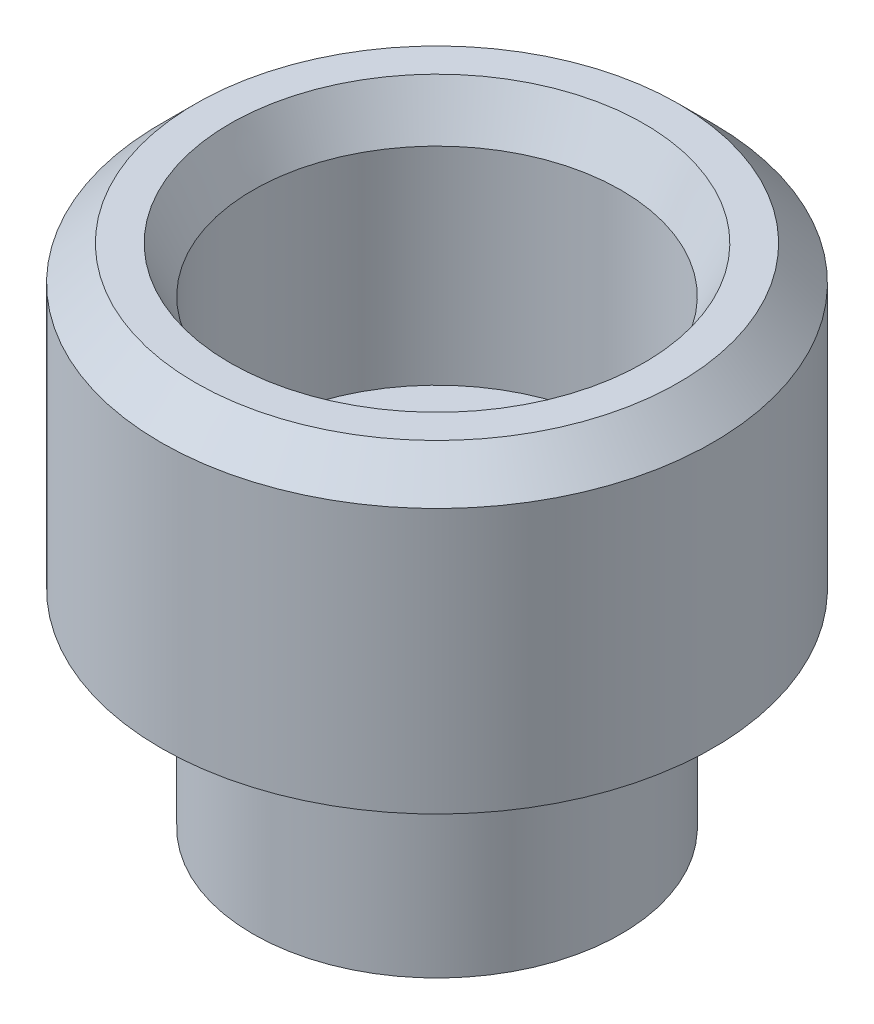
ISO-10303-21;
HEADER;
FILE_DESCRIPTION(('STEP AP214'),'2;1');
FILE_NAME('part.step','',(''),(''),'','','');
FILE_SCHEMA(('AUTOMOTIVE_DESIGN { 1 0 10303 214 1 1 1 1 }'));
ENDSEC;
DATA;
#1=APPLICATION_CONTEXT('core data for automotive mechanical design processes');
#2=APPLICATION_PROTOCOL_DEFINITION('international standard','automotive_design',2000,#1);
#3=PRODUCT_CONTEXT('',#1,'mechanical');
#4=PRODUCT('Part','Part','',(#3));
#5=PRODUCT_RELATED_PRODUCT_CATEGORY('part','',(#4));
#6=PRODUCT_DEFINITION_FORMATION('','',#4);
#7=PRODUCT_DEFINITION_CONTEXT('part definition',#1,'design');
#8=PRODUCT_DEFINITION('design','',#6,#7);
#9=PRODUCT_DEFINITION_SHAPE('','',#8);
#10=(LENGTH_UNIT() NAMED_UNIT(*) SI_UNIT(.MILLI.,.METRE.));
#11=(NAMED_UNIT(*) PLANE_ANGLE_UNIT() SI_UNIT($,.RADIAN.));
#12=(NAMED_UNIT(*) SI_UNIT($,.STERADIAN.) SOLID_ANGLE_UNIT());
#13=UNCERTAINTY_MEASURE_WITH_UNIT(LENGTH_MEASURE(1.E-05),#10,'distance_accuracy_value','');
#14=(GEOMETRIC_REPRESENTATION_CONTEXT(3) GLOBAL_UNCERTAINTY_ASSIGNED_CONTEXT((#13)) GLOBAL_UNIT_ASSIGNED_CONTEXT((#10,
#11,#12)) REPRESENTATION_CONTEXT('',''));
#15=CARTESIAN_POINT('',(0.,0.,0.));
#16=DIRECTION('',(0.,0.,1.));
#17=DIRECTION('',(1.,0.,0.));
#18=AXIS2_PLACEMENT_3D('',#15,#16,#17);
#19=CARTESIAN_POINT('',(0.,9.,0.));
#20=DIRECTION('',(0.,-1.,0.));
#21=DIRECTION('',(0.,0.,-1.));
#22=AXIS2_PLACEMENT_3D('',#19,#20,#21);
#23=CYLINDRICAL_SURFACE('',#22,8.);
#24=CARTESIAN_POINT('',(0.,6.5,0.));
#25=DIRECTION('',(0.,1.,0.));
#26=DIRECTION('',(0.,0.,1.));
#27=AXIS2_PLACEMENT_3D('',#24,#25,#26);
#28=CIRCLE('',#27,8.);
#29=CARTESIAN_POINT('',(0.,6.5,8.));
#30=VERTEX_POINT('',#29);
#31=EDGE_CURVE('E53',#30,#30,#28,.F.);
#32=ORIENTED_EDGE('',*,*,#31,.T.);
#33=EDGE_LOOP('',(#32));
#34=FACE_BOUND('',#33,.T.);
#35=CARTESIAN_POINT('',(0.,0.,0.));
#36=DIRECTION('',(0.,1.,0.));
#37=DIRECTION('',(0.,0.,1.));
#38=AXIS2_PLACEMENT_3D('',#35,#36,#37);
#39=CIRCLE('',#38,8.);
#40=CARTESIAN_POINT('',(0.,0.,8.));
#41=VERTEX_POINT('',#40);
#42=EDGE_CURVE('E56',#41,#41,#39,.T.);
#43=ORIENTED_EDGE('',*,*,#42,.T.);
#44=EDGE_LOOP('',(#43));
#45=FACE_BOUND('',#44,.T.);
#46=ADVANCED_FACE('F33',(#34,#45),#23,.T.);
#47=CARTESIAN_POINT('',(0.,0.,0.));
#48=DIRECTION('',(0.,1.,0.));
#49=DIRECTION('',(0.,0.,1.));
#50=AXIS2_PLACEMENT_3D('',#47,#48,#49);
#51=PLANE('',#50);
#52=CARTESIAN_POINT('',(0.,0.,0.));
#53=DIRECTION('',(0.,-1.,0.));
#54=DIRECTION('',(0.,0.,-1.));
#55=AXIS2_PLACEMENT_3D('',#52,#53,#54);
#56=CIRCLE('',#55,3.5);
#57=CARTESIAN_POINT('',(0.,0.,-3.5));
#58=VERTEX_POINT('',#57);
#59=EDGE_CURVE('E62',#58,#58,#56,.T.);
#60=ORIENTED_EDGE('',*,*,#59,.F.);
#61=EDGE_LOOP('',(#60));
#62=FACE_BOUND('',#61,.T.);
#63=ORIENTED_EDGE('',*,*,#42,.F.);
#64=EDGE_LOOP('',(#63));
#65=FACE_BOUND('',#64,.T.);
#66=ADVANCED_FACE('F87',(#62,#65),#51,.F.);
#67=CARTESIAN_POINT('',(0.,22.,0.));
#68=DIRECTION('',(0.,-1.,0.));
#69=DIRECTION('',(0.,0.,-1.));
#70=AXIS2_PLACEMENT_3D('',#67,#68,#69);
#71=CYLINDRICAL_SURFACE('',#70,12.);
#72=CARTESIAN_POINT('',(0.,20.5,0.));
#73=DIRECTION('',(0.,1.,0.));
#74=DIRECTION('',(0.,0.,1.));
#75=AXIS2_PLACEMENT_3D('',#72,#73,#74);
#76=CIRCLE('',#75,12.);
#77=CARTESIAN_POINT('',(0.,20.5,-12.));
#78=VERTEX_POINT('',#77);
#79=EDGE_CURVE('E44',#78,#78,#76,.F.);
#80=CARTESIAN_POINT('',(0.,9.,0.));
#81=DIRECTION('',(0.,1.,0.));
#82=DIRECTION('',(0.,0.,1.));
#83=AXIS2_PLACEMENT_3D('',#80,#81,#82);
#84=CIRCLE('',#83,12.);
#85=CARTESIAN_POINT('',(0.,9.,-12.));
#86=VERTEX_POINT('',#85);
#87=EDGE_CURVE('E59',#86,#86,#84,.T.);
#88=CARTESIAN_POINT('',(0.,20.5,-12.));
#89=CARTESIAN_POINT('',(0.,20.3802083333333,-12.));
#90=CARTESIAN_POINT('',(0.,20.2604166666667,-12.));
#91=CARTESIAN_POINT('',(0.,20.0208333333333,-12.));
#92=CARTESIAN_POINT('',(0.,19.9010416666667,-12.));
#93=CARTESIAN_POINT('',(0.,19.6614583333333,-12.));
#94=CARTESIAN_POINT('',(0.,19.5416666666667,-12.));
#95=CARTESIAN_POINT('',(0.,19.3020833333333,-12.));
#96=CARTESIAN_POINT('',(0.,19.1822916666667,-12.));
#97=CARTESIAN_POINT('',(0.,18.9427083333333,-12.));
#98=CARTESIAN_POINT('',(0.,18.8229166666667,-12.));
#99=CARTESIAN_POINT('',(0.,18.5833333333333,-12.));
#100=CARTESIAN_POINT('',(0.,18.4635416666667,-12.));
#101=CARTESIAN_POINT('',(0.,18.2239583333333,-12.));
#102=CARTESIAN_POINT('',(0.,18.1041666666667,-12.));
#103=CARTESIAN_POINT('',(0.,17.8645833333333,-12.));
#104=CARTESIAN_POINT('',(0.,17.7447916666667,-12.));
#105=CARTESIAN_POINT('',(0.,17.5052083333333,-12.));
#106=CARTESIAN_POINT('',(0.,17.3854166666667,-12.));
#107=CARTESIAN_POINT('',(0.,17.1458333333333,-12.));
#108=CARTESIAN_POINT('',(0.,17.0260416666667,-12.));
#109=CARTESIAN_POINT('',(0.,16.7864583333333,-12.));
#110=CARTESIAN_POINT('',(0.,16.6666666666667,-12.));
#111=CARTESIAN_POINT('',(0.,16.4270833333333,-12.));
#112=CARTESIAN_POINT('',(0.,16.3072916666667,-12.));
#113=CARTESIAN_POINT('',(0.,16.0677083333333,-12.));
#114=CARTESIAN_POINT('',(0.,15.9479166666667,-12.));
#115=CARTESIAN_POINT('',(0.,15.7083333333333,-12.));
#116=CARTESIAN_POINT('',(0.,15.5885416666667,-12.));
#117=CARTESIAN_POINT('',(0.,15.3489583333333,-12.));
#118=CARTESIAN_POINT('',(0.,15.2291666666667,-12.));
#119=CARTESIAN_POINT('',(0.,14.9895833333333,-12.));
#120=CARTESIAN_POINT('',(0.,14.8697916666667,-12.));
#121=CARTESIAN_POINT('',(0.,14.6302083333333,-12.));
#122=CARTESIAN_POINT('',(0.,14.5104166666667,-12.));
#123=CARTESIAN_POINT('',(0.,14.2708333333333,-12.));
#124=CARTESIAN_POINT('',(0.,14.1510416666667,-12.));
#125=CARTESIAN_POINT('',(0.,13.9114583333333,-12.));
#126=CARTESIAN_POINT('',(0.,13.7916666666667,-12.));
#127=CARTESIAN_POINT('',(0.,13.5520833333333,-12.));
#128=CARTESIAN_POINT('',(0.,13.4322916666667,-12.));
#129=CARTESIAN_POINT('',(0.,13.1927083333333,-12.));
#130=CARTESIAN_POINT('',(0.,13.0729166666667,-12.));
#131=CARTESIAN_POINT('',(0.,12.8333333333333,-12.));
#132=CARTESIAN_POINT('',(0.,12.7135416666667,-12.));
#133=CARTESIAN_POINT('',(0.,12.4739583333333,-12.));
#134=CARTESIAN_POINT('',(0.,12.3541666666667,-12.));
#135=CARTESIAN_POINT('',(0.,12.1145833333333,-12.));
#136=CARTESIAN_POINT('',(0.,11.9947916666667,-12.));
#137=CARTESIAN_POINT('',(0.,11.7552083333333,-12.));
#138=CARTESIAN_POINT('',(0.,11.6354166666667,-12.));
#139=CARTESIAN_POINT('',(0.,11.3958333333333,-12.));
#140=CARTESIAN_POINT('',(0.,11.2760416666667,-12.));
#141=CARTESIAN_POINT('',(0.,11.0364583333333,-12.));
#142=CARTESIAN_POINT('',(0.,10.9166666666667,-12.));
#143=CARTESIAN_POINT('',(0.,10.6770833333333,-12.));
#144=CARTESIAN_POINT('',(0.,10.5572916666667,-12.));
#145=CARTESIAN_POINT('',(0.,10.3177083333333,-12.));
#146=CARTESIAN_POINT('',(0.,10.1979166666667,-12.));
#147=CARTESIAN_POINT('',(0.,9.95833333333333,-12.));
#148=CARTESIAN_POINT('',(0.,9.83854166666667,-12.));
#149=CARTESIAN_POINT('',(0.,9.59895833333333,-12.));
#150=CARTESIAN_POINT('',(0.,9.47916666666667,-12.));
#151=CARTESIAN_POINT('',(0.,9.23958333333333,-12.));
#152=CARTESIAN_POINT('',(0.,9.11979166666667,-12.));
#153=CARTESIAN_POINT('',(0.,9.,-12.));
#154=B_SPLINE_CURVE_WITH_KNOTS('',3,(#88,#89,#90,#91,#92,#93,#94,#95,#96,#97,#98,#99,#100,#101,
#102,#103,#104,#105,#106,#107,#108,#109,#110,#111,#112,#113,#114,#115,#116,#117,#118,#119,#120,
#121,#122,#123,#124,#125,#126,#127,#128,#129,#130,#131,#132,#133,#134,#135,#136,#137,#138,#139,
#140,#141,#142,#143,#144,#145,#146,#147,#148,#149,#150,#151,#152,#153),.UNSPECIFIED.,.F.,.F.,(4,
2,2,2,2,2,2,2,2,2,2,2,2,2,2,2,2,2,2,2,2,2,2,2,2,2,2,2,2,2,2,2,4),(0.,0.359375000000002,
0.718750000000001,1.078125,1.4375,1.796875,2.15625,2.515625,2.875,3.234375,3.59375,
3.95312500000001,4.3125,4.671875,5.03125,5.390625,5.75000000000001,6.10937500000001,6.46875,
6.82812500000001,7.1875,7.54687500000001,7.90625000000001,8.26562500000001,8.62500000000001,
8.98437500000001,9.34375000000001,9.70312500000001,10.0625,10.421875,10.78125,11.140625,11.5),.UNSPECIFIED.);
#155=EDGE_CURVE('BSEAM93',#78,#86,#154,.T.);
#156=ORIENTED_EDGE('',*,*,#79,.T.);
#157=ORIENTED_EDGE('',*,*,#87,.T.);
#158=ORIENTED_EDGE('',*,*,#155,.T.);
#159=ORIENTED_EDGE('',*,*,#155,.F.);
#160=EDGE_LOOP('',(#156,#158,#157,#159));
#161=FACE_BOUND('',#160,.T.);
#162=ADVANCED_FACE('F93',(#161),#71,.T.);
#163=CARTESIAN_POINT('',(0.,22.,0.));
#164=DIRECTION('',(0.,1.,0.));
#165=DIRECTION('',(0.,0.,1.));
#166=AXIS2_PLACEMENT_3D('',#163,#164,#165);
#167=PLANE('',#166);
#168=CARTESIAN_POINT('',(0.,22.,0.));
#169=DIRECTION('',(0.,1.,0.));
#170=DIRECTION('',(0.,0.,1.));
#171=AXIS2_PLACEMENT_3D('',#168,#169,#170);
#172=CIRCLE('',#171,9.00000000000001);
#173=CARTESIAN_POINT('',(0.,22.,9.00000000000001));
#174=VERTEX_POINT('',#173);
#175=EDGE_CURVE('E10',#174,#174,#172,.F.);
#176=ORIENTED_EDGE('',*,*,#175,.T.);
#177=EDGE_LOOP('',(#176));
#178=FACE_BOUND('',#177,.T.);
#179=CARTESIAN_POINT('',(0.,22.,0.));
#180=DIRECTION('',(0.,1.,0.));
#181=DIRECTION('',(0.,0.,1.));
#182=AXIS2_PLACEMENT_3D('',#179,#180,#181);
#183=CIRCLE('',#182,10.5);
#184=CARTESIAN_POINT('',(0.,22.,10.5));
#185=VERTEX_POINT('',#184);
#186=EDGE_CURVE('E48',#185,#185,#183,.T.);
#187=ORIENTED_EDGE('',*,*,#186,.T.);
#188=EDGE_LOOP('',(#187));
#189=FACE_BOUND('',#188,.T.);
#190=ADVANCED_FACE('F102',(#178,#189),#167,.T.);
#191=CARTESIAN_POINT('',(0.,9.,0.));
#192=DIRECTION('',(0.,1.,0.));
#193=DIRECTION('',(0.,0.,1.));
#194=AXIS2_PLACEMENT_3D('',#191,#192,#193);
#195=CONICAL_SURFACE('',#194,12.,1.01219701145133);
#196=ORIENTED_EDGE('',*,*,#31,.F.);
#197=EDGE_LOOP('',(#196));
#198=FACE_BOUND('',#197,.T.);
#199=ORIENTED_EDGE('',*,*,#87,.F.);
#200=EDGE_LOOP('',(#199));
#201=FACE_BOUND('',#200,.T.);
#202=ADVANCED_FACE('F99',(#198,#201),#195,.T.);
#203=CARTESIAN_POINT('',(0.,22.,0.));
#204=DIRECTION('',(0.,-1.,0.));
#205=DIRECTION('',(0.,0.,-1.));
#206=AXIS2_PLACEMENT_3D('',#203,#204,#205);
#207=CONICAL_SURFACE('',#206,10.5,0.785398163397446);
#208=ORIENTED_EDGE('',*,*,#79,.F.);
#209=EDGE_LOOP('',(#208));
#210=FACE_BOUND('',#209,.T.);
#211=ORIENTED_EDGE('',*,*,#186,.F.);
#212=EDGE_LOOP('',(#211));
#213=FACE_BOUND('',#212,.T.);
#214=ADVANCED_FACE('F101',(#210,#213),#207,.T.);
#215=CARTESIAN_POINT('',(0.,11.,0.));
#216=DIRECTION('',(0.,-1.,0.));
#217=DIRECTION('',(0.,0.,-1.));
#218=AXIS2_PLACEMENT_3D('',#215,#216,#217);
#219=CYLINDRICAL_SURFACE('',#218,3.5);
#220=CARTESIAN_POINT('',(0.,11.,0.));
#221=DIRECTION('',(0.,1.,0.));
#222=DIRECTION('',(0.,0.,1.));
#223=AXIS2_PLACEMENT_3D('',#220,#221,#222);
#224=CIRCLE('',#223,3.5);
#225=CARTESIAN_POINT('',(0.,11.,3.5));
#226=VERTEX_POINT('',#225);
#227=EDGE_CURVE('E65',#226,#226,#224,.F.);
#228=ORIENTED_EDGE('',*,*,#227,.F.);
#229=EDGE_LOOP('',(#228));
#230=FACE_BOUND('',#229,.T.);
#231=ORIENTED_EDGE('',*,*,#59,.T.);
#232=EDGE_LOOP('',(#231));
#233=FACE_BOUND('',#232,.T.);
#234=ADVANCED_FACE('F83',(#230,#233),#219,.F.);
#235=CARTESIAN_POINT('',(0.,11.,0.));
#236=DIRECTION('',(0.,1.,0.));
#237=DIRECTION('',(0.,0.,1.));
#238=AXIS2_PLACEMENT_3D('',#235,#236,#237);
#239=PLANE('',#238);
#240=CARTESIAN_POINT('',(0.,11.,0.));
#241=DIRECTION('',(0.,1.,0.));
#242=DIRECTION('',(0.,0.,1.));
#243=AXIS2_PLACEMENT_3D('',#240,#241,#242);
#244=CIRCLE('',#243,8.);
#245=CARTESIAN_POINT('',(0.,11.,8.));
#246=VERTEX_POINT('',#245);
#247=EDGE_CURVE('E68',#246,#246,#244,.T.);
#248=ORIENTED_EDGE('',*,*,#247,.T.);
#249=EDGE_LOOP('',(#248));
#250=FACE_BOUND('',#249,.T.);
#251=ORIENTED_EDGE('',*,*,#227,.T.);
#252=EDGE_LOOP('',(#251));
#253=FACE_BOUND('',#252,.T.);
#254=ADVANCED_FACE('F72',(#250,#253),#239,.T.);
#255=CARTESIAN_POINT('',(0.,11.,0.));
#256=DIRECTION('',(0.,1.,0.));
#257=DIRECTION('',(0.,0.,1.));
#258=AXIS2_PLACEMENT_3D('',#255,#256,#257);
#259=CYLINDRICAL_SURFACE('',#258,8.);
#260=CARTESIAN_POINT('',(0.,20.,0.));
#261=DIRECTION('',(0.,1.,0.));
#262=DIRECTION('',(0.,0.,1.));
#263=AXIS2_PLACEMENT_3D('',#260,#261,#262);
#264=CIRCLE('',#263,8.);
#265=CARTESIAN_POINT('',(0.,20.,8.));
#266=VERTEX_POINT('',#265);
#267=EDGE_CURVE('E40',#266,#266,#264,.T.);
#268=ORIENTED_EDGE('',*,*,#267,.T.);
#269=EDGE_LOOP('',(#268));
#270=FACE_BOUND('',#269,.T.);
#271=ORIENTED_EDGE('',*,*,#247,.F.);
#272=EDGE_LOOP('',(#271));
#273=FACE_BOUND('',#272,.T.);
#274=ADVANCED_FACE('F75',(#270,#273),#259,.F.);
#275=CARTESIAN_POINT('',(0.,20.,0.));
#276=DIRECTION('',(0.,1.,0.));
#277=DIRECTION('',(0.,0.,1.));
#278=AXIS2_PLACEMENT_3D('',#275,#276,#277);
#279=CONICAL_SURFACE('',#278,8.,0.463647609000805);
#280=ORIENTED_EDGE('',*,*,#175,.F.);
#281=EDGE_LOOP('',(#280));
#282=FACE_BOUND('',#281,.T.);
#283=ORIENTED_EDGE('',*,*,#267,.F.);
#284=EDGE_LOOP('',(#283));
#285=FACE_BOUND('',#284,.T.);
#286=ADVANCED_FACE('F35',(#282,#285),#279,.F.);
#287=CLOSED_SHELL('',(#46,#66,#162,#190,#202,#214,#234,#254,#274,#286));
#288=MANIFOLD_SOLID_BREP('B2',#287);
#289=ADVANCED_BREP_SHAPE_REPRESENTATION('',(#18,#288),#14);
#290=SHAPE_DEFINITION_REPRESENTATION(#9,#289);
ENDSEC;
END-ISO-10303-21;
